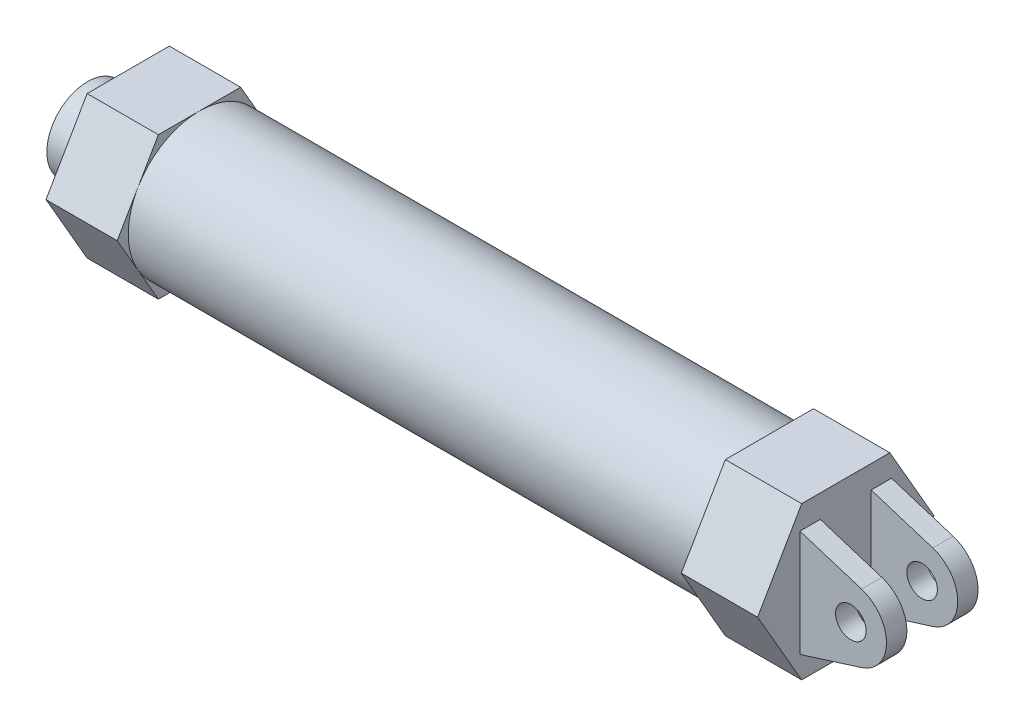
ISO-10303-21;
HEADER;
FILE_DESCRIPTION(('STEP AP214'),'2;1');
FILE_NAME('part.step','',(''),(''),'','','');
FILE_SCHEMA(('AUTOMOTIVE_DESIGN { 1 0 10303 214 1 1 1 1 }'));
ENDSEC;
DATA;
#1=APPLICATION_CONTEXT('core data for automotive mechanical design processes');
#2=APPLICATION_PROTOCOL_DEFINITION('international standard','automotive_design',2000,#1);
#3=PRODUCT_CONTEXT('',#1,'mechanical');
#4=PRODUCT('Part','Part','',(#3));
#5=PRODUCT_RELATED_PRODUCT_CATEGORY('part','',(#4));
#6=PRODUCT_DEFINITION_FORMATION('','',#4);
#7=PRODUCT_DEFINITION_CONTEXT('part definition',#1,'design');
#8=PRODUCT_DEFINITION('design','',#6,#7);
#9=PRODUCT_DEFINITION_SHAPE('','',#8);
#10=(LENGTH_UNIT() NAMED_UNIT(*) SI_UNIT(.MILLI.,.METRE.));
#11=(NAMED_UNIT(*) PLANE_ANGLE_UNIT() SI_UNIT($,.RADIAN.));
#12=(NAMED_UNIT(*) SI_UNIT($,.STERADIAN.) SOLID_ANGLE_UNIT());
#13=UNCERTAINTY_MEASURE_WITH_UNIT(LENGTH_MEASURE(1.E-05),#10,'distance_accuracy_value','');
#14=(GEOMETRIC_REPRESENTATION_CONTEXT(3) GLOBAL_UNCERTAINTY_ASSIGNED_CONTEXT((#13)) GLOBAL_UNIT_ASSIGNED_CONTEXT((#10,
#11,#12)) REPRESENTATION_CONTEXT('',''));
#15=CARTESIAN_POINT('',(0.,0.,0.));
#16=DIRECTION('',(0.,0.,1.));
#17=DIRECTION('',(1.,0.,0.));
#18=AXIS2_PLACEMENT_3D('',#15,#16,#17);
#19=CARTESIAN_POINT('',(31.75,0.,28.575));
#20=DIRECTION('',(0.,0.,-1.));
#21=DIRECTION('',(-1.,0.,0.));
#22=AXIS2_PLACEMENT_3D('',#19,#20,#21);
#23=CYLINDRICAL_SURFACE('',#22,22.225);
#24=DIRECTION('',(0.,0.,-1.));
#25=VECTOR('',#24,1.);
#26=CARTESIAN_POINT('',(38.4331863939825,-21.1963592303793,28.575));
#27=LINE('',#26,#25);
#28=CARTESIAN_POINT('',(38.4331863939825,-21.1963592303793,28.575));
#29=VERTEX_POINT('',#28);
#30=CARTESIAN_POINT('',(38.4331863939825,-21.1963592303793,15.875));
#31=VERTEX_POINT('',#30);
#32=EDGE_CURVE('E210',#29,#31,#27,.T.);
#33=ORIENTED_EDGE('',*,*,#32,.T.);
#34=CARTESIAN_POINT('',(31.75,0.,15.875));
#35=DIRECTION('',(0.,0.,-1.));
#36=DIRECTION('',(-1.,0.,0.));
#37=AXIS2_PLACEMENT_3D('',#34,#35,#36);
#38=CIRCLE('',#37,22.225);
#39=CARTESIAN_POINT('',(38.4331863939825,21.1963592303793,15.875));
#40=VERTEX_POINT('',#39);
#41=EDGE_CURVE('E50',#40,#31,#38,.T.);
#42=ORIENTED_EDGE('',*,*,#41,.F.);
#43=DIRECTION('',(0.,0.,-1.));
#44=VECTOR('',#43,1.);
#45=CARTESIAN_POINT('',(38.4331863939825,21.1963592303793,28.575));
#46=LINE('',#45,#44);
#47=CARTESIAN_POINT('',(38.4331863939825,21.1963592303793,28.575));
#48=VERTEX_POINT('',#47);
#49=EDGE_CURVE('E215',#48,#40,#46,.T.);
#50=ORIENTED_EDGE('',*,*,#49,.F.);
#51=CARTESIAN_POINT('',(31.75,0.,28.575));
#52=DIRECTION('',(0.,0.,1.));
#53=DIRECTION('',(1.,0.,0.));
#54=AXIS2_PLACEMENT_3D('',#51,#52,#53);
#55=CIRCLE('',#54,22.225);
#56=EDGE_CURVE('E364',#29,#48,#55,.T.);
#57=ORIENTED_EDGE('',*,*,#56,.F.);
#58=EDGE_LOOP('',(#33,#42,#50,#57));
#59=FACE_BOUND('',#58,.T.);
#60=ADVANCED_FACE('F33',(#59),#23,.T.);
#61=CARTESIAN_POINT('',(38.4331863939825,21.1963592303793,28.575));
#62=DIRECTION('',(-0.300705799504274,-0.953716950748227,0.));
#63=DIRECTION('',(0.953716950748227,-0.300705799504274,0.));
#64=AXIS2_PLACEMENT_3D('',#61,#62,#63);
#65=PLANE('',#64);
#66=DIRECTION('',(0.953716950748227,-0.300705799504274,0.));
#67=VECTOR('',#66,1.);
#68=CARTESIAN_POINT('',(38.4331863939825,21.1963592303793,15.875));
#69=LINE('',#68,#67);
#70=CARTESIAN_POINT('',(0.,33.3142963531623,15.875));
#71=VERTEX_POINT('',#70);
#72=EDGE_CURVE('E347',#71,#40,#69,.T.);
#73=ORIENTED_EDGE('',*,*,#72,.F.);
#74=DIRECTION('',(0.,0.,-1.));
#75=VECTOR('',#74,1.);
#76=CARTESIAN_POINT('',(0.,33.3142963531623,28.575));
#77=LINE('',#76,#75);
#78=CARTESIAN_POINT('',(0.,33.3142963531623,28.575));
#79=VERTEX_POINT('',#78);
#80=EDGE_CURVE('E202',#79,#71,#77,.T.);
#81=ORIENTED_EDGE('',*,*,#80,.F.);
#82=DIRECTION('',(-0.953716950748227,0.300705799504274,0.));
#83=VECTOR('',#82,1.);
#84=CARTESIAN_POINT('',(38.4331863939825,21.1963592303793,28.575));
#85=LINE('',#84,#83);
#86=EDGE_CURVE('E367',#48,#79,#85,.T.);
#87=ORIENTED_EDGE('',*,*,#86,.F.);
#88=ORIENTED_EDGE('',*,*,#49,.T.);
#89=EDGE_LOOP('',(#73,#81,#87,#88));
#90=FACE_BOUND('',#89,.T.);
#91=ADVANCED_FACE('F405',(#90),#65,.F.);
#92=CARTESIAN_POINT('',(38.4331863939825,-21.1963592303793,28.575));
#93=DIRECTION('',(0.300705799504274,-0.953716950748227,0.));
#94=DIRECTION('',(0.953716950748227,0.300705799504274,0.));
#95=AXIS2_PLACEMENT_3D('',#92,#93,#94);
#96=PLANE('',#95);
#97=DIRECTION('',(0.,0.,-1.));
#98=VECTOR('',#97,1.);
#99=CARTESIAN_POINT('',(0.,-33.3142963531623,28.575));
#100=LINE('',#99,#98);
#101=CARTESIAN_POINT('',(0.,-33.3142963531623,28.575));
#102=VERTEX_POINT('',#101);
#103=CARTESIAN_POINT('',(0.,-33.3142963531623,15.875));
#104=VERTEX_POINT('',#103);
#105=EDGE_CURVE('E200',#102,#104,#100,.T.);
#106=ORIENTED_EDGE('',*,*,#105,.T.);
#107=DIRECTION('',(0.953716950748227,0.300705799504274,0.));
#108=VECTOR('',#107,1.);
#109=CARTESIAN_POINT('',(38.4331863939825,-21.1963592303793,15.875));
#110=LINE('',#109,#108);
#111=EDGE_CURVE('E187',#104,#31,#110,.T.);
#112=ORIENTED_EDGE('',*,*,#111,.T.);
#113=ORIENTED_EDGE('',*,*,#32,.F.);
#114=DIRECTION('',(-0.953716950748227,-0.300705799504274,0.));
#115=VECTOR('',#114,1.);
#116=CARTESIAN_POINT('',(38.4331863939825,-21.1963592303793,28.575));
#117=LINE('',#116,#115);
#118=EDGE_CURVE('E58',#29,#102,#117,.T.);
#119=ORIENTED_EDGE('',*,*,#118,.T.);
#120=EDGE_LOOP('',(#106,#112,#113,#119));
#121=FACE_BOUND('',#120,.T.);
#122=ADVANCED_FACE('F205',(#121),#96,.T.);
#123=CARTESIAN_POINT('',(31.75,0.,28.575));
#124=DIRECTION('',(0.,0.,-1.));
#125=DIRECTION('',(-1.,0.,0.));
#126=AXIS2_PLACEMENT_3D('',#123,#124,#125);
#127=CYLINDRICAL_SURFACE('',#126,9.525);
#128=CARTESIAN_POINT('',(31.75,0.,28.575));
#129=DIRECTION('',(0.,0.,1.));
#130=DIRECTION('',(1.,0.,0.));
#131=AXIS2_PLACEMENT_3D('',#128,#129,#130);
#132=CIRCLE('',#131,9.525);
#133=CARTESIAN_POINT('',(41.275,0.,28.575));
#134=VERTEX_POINT('',#133);
#135=EDGE_CURVE('E358',#134,#134,#132,.T.);
#136=ORIENTED_EDGE('',*,*,#135,.T.);
#137=EDGE_LOOP('',(#136));
#138=FACE_BOUND('',#137,.T.);
#139=CARTESIAN_POINT('',(31.75,0.,15.875));
#140=DIRECTION('',(0.,0.,-1.));
#141=DIRECTION('',(-1.,0.,0.));
#142=AXIS2_PLACEMENT_3D('',#139,#140,#141);
#143=CIRCLE('',#142,9.525);
#144=CARTESIAN_POINT('',(22.225,0.,15.875));
#145=VERTEX_POINT('',#144);
#146=EDGE_CURVE('E193',#145,#145,#143,.T.);
#147=ORIENTED_EDGE('',*,*,#146,.T.);
#148=EDGE_LOOP('',(#147));
#149=FACE_BOUND('',#148,.T.);
#150=ADVANCED_FACE('F412',(#138,#149),#127,.F.);
#151=CARTESIAN_POINT('',(0.,-47.625,-82.4889197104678));
#152=DIRECTION('',(-1.,0.,0.));
#153=DIRECTION('',(0.,0.,1.));
#154=AXIS2_PLACEMENT_3D('',#151,#152,#153);
#155=PLANE('',#154);
#156=DIRECTION('',(0.,1.,0.));
#157=VECTOR('',#156,1.);
#158=CARTESIAN_POINT('',(0.,-47.625,-15.875));
#159=LINE('',#158,#157);
#160=CARTESIAN_POINT('',(0.,-33.3142963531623,-15.875));
#161=VERTEX_POINT('',#160);
#162=CARTESIAN_POINT('',(0.,33.3142963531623,-15.875));
#163=VERTEX_POINT('',#162);
#164=EDGE_CURVE('E203',#161,#163,#159,.T.);
#165=ORIENTED_EDGE('',*,*,#164,.T.);
#166=CARTESIAN_POINT('',(0.,33.3142963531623,-28.575));
#167=VERTEX_POINT('',#166);
#168=EDGE_CURVE('E206',#163,#167,#77,.T.);
#169=ORIENTED_EDGE('',*,*,#168,.T.);
#170=DIRECTION('',(0.,-1.,0.));
#171=VECTOR('',#170,1.);
#172=CARTESIAN_POINT('',(0.,33.3142963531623,-28.575));
#173=LINE('',#172,#171);
#174=CARTESIAN_POINT('',(0.,-33.3142963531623,-28.575));
#175=VERTEX_POINT('',#174);
#176=EDGE_CURVE('E379',#167,#175,#173,.T.);
#177=ORIENTED_EDGE('',*,*,#176,.T.);
#178=EDGE_CURVE('E207',#161,#175,#100,.T.);
#179=ORIENTED_EDGE('',*,*,#178,.F.);
#180=EDGE_LOOP('',(#165,#169,#177,#179));
#181=FACE_BOUND('',#180,.T.);
#182=DIRECTION('',(0.,0.,1.));
#183=VECTOR('',#182,1.);
#184=CARTESIAN_POINT('',(0.,47.625,-27.4963065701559));
#185=LINE('',#184,#183);
#186=CARTESIAN_POINT('',(0.,47.625,-27.4963065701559));
#187=VERTEX_POINT('',#186);
#188=CARTESIAN_POINT('',(0.,47.625,27.4963065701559));
#189=VERTEX_POINT('',#188);
#190=EDGE_CURVE('E316',#187,#189,#185,.T.);
#191=ORIENTED_EDGE('',*,*,#190,.T.);
#192=DIRECTION('',(0.,-0.866025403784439,0.5));
#193=VECTOR('',#192,1.);
#194=CARTESIAN_POINT('',(0.,47.625,27.4963065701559));
#195=LINE('',#194,#193);
#196=CARTESIAN_POINT('',(0.,0.,54.9926131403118));
#197=VERTEX_POINT('',#196);
#198=EDGE_CURVE('E318',#189,#197,#195,.T.);
#199=ORIENTED_EDGE('',*,*,#198,.T.);
#200=DIRECTION('',(0.,-0.866025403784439,-0.5));
#201=VECTOR('',#200,1.);
#202=CARTESIAN_POINT('',(0.,0.,54.9926131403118));
#203=LINE('',#202,#201);
#204=CARTESIAN_POINT('',(0.,-47.625,27.4963065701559));
#205=VERTEX_POINT('',#204);
#206=EDGE_CURVE('E321',#197,#205,#203,.T.);
#207=ORIENTED_EDGE('',*,*,#206,.T.);
#208=DIRECTION('',(0.,0.,-1.));
#209=VECTOR('',#208,1.);
#210=CARTESIAN_POINT('',(0.,-47.625,27.4963065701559));
#211=LINE('',#210,#209);
#212=CARTESIAN_POINT('',(0.,-47.625,-27.4963065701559));
#213=VERTEX_POINT('',#212);
#214=EDGE_CURVE('E324',#205,#213,#211,.T.);
#215=ORIENTED_EDGE('',*,*,#214,.T.);
#216=DIRECTION('',(0.,0.866025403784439,-0.5));
#217=VECTOR('',#216,1.);
#218=CARTESIAN_POINT('',(0.,-47.625,-27.4963065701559));
#219=LINE('',#218,#217);
#220=CARTESIAN_POINT('',(0.,0.,-54.9926131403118));
#221=VERTEX_POINT('',#220);
#222=EDGE_CURVE('E298',#213,#221,#219,.T.);
#223=ORIENTED_EDGE('',*,*,#222,.T.);
#224=DIRECTION('',(0.,0.866025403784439,0.5));
#225=VECTOR('',#224,1.);
#226=CARTESIAN_POINT('',(0.,0.,-54.9926131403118));
#227=LINE('',#226,#225);
#228=EDGE_CURVE('E289',#221,#187,#227,.T.);
#229=ORIENTED_EDGE('',*,*,#228,.T.);
#230=EDGE_LOOP('',(#191,#199,#207,#215,#223,#229));
#231=FACE_BOUND('',#230,.T.);
#232=ORIENTED_EDGE('',*,*,#80,.T.);
#233=DIRECTION('',(0.,1.,0.));
#234=VECTOR('',#233,1.);
#235=CARTESIAN_POINT('',(0.,-47.625,15.875));
#236=LINE('',#235,#234);
#237=EDGE_CURVE('E190',#104,#71,#236,.T.);
#238=ORIENTED_EDGE('',*,*,#237,.F.);
#239=ORIENTED_EDGE('',*,*,#105,.F.);
#240=DIRECTION('',(0.,-1.,0.));
#241=VECTOR('',#240,1.);
#242=CARTESIAN_POINT('',(0.,33.3142963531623,28.575));
#243=LINE('',#242,#241);
#244=EDGE_CURVE('E370',#79,#102,#243,.T.);
#245=ORIENTED_EDGE('',*,*,#244,.F.);
#246=EDGE_LOOP('',(#232,#238,#239,#245));
#247=FACE_BOUND('',#246,.T.);
#248=ADVANCED_FACE('F198',(#181,#231,#247),#155,.F.);
#249=CARTESIAN_POINT('',(-447.675,44.45,-25.6632194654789));
#250=DIRECTION('',(-1.,0.,0.));
#251=DIRECTION('',(0.,0.,1.));
#252=AXIS2_PLACEMENT_3D('',#249,#250,#251);
#253=PLANE('',#252);
#254=DIRECTION('',(0.,0.,-1.));
#255=VECTOR('',#254,1.);
#256=CARTESIAN_POINT('',(-447.675,44.45,25.6632194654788));
#257=LINE('',#256,#255);
#258=CARTESIAN_POINT('',(-447.675,44.45,25.6632194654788));
#259=VERTEX_POINT('',#258);
#260=CARTESIAN_POINT('',(-447.675,44.45,-25.6632194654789));
#261=VERTEX_POINT('',#260);
#262=EDGE_CURVE('E231',#259,#261,#257,.T.);
#263=ORIENTED_EDGE('',*,*,#262,.T.);
#264=DIRECTION('',(0.,-0.866025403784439,-0.499999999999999));
#265=VECTOR('',#264,1.);
#266=CARTESIAN_POINT('',(-447.675,44.45,-25.6632194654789));
#267=LINE('',#266,#265);
#268=CARTESIAN_POINT('',(-447.675,0.,-51.3264389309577));
#269=VERTEX_POINT('',#268);
#270=EDGE_CURVE('E234',#261,#269,#267,.T.);
#271=ORIENTED_EDGE('',*,*,#270,.T.);
#272=DIRECTION('',(0.,-0.866025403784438,0.5));
#273=VECTOR('',#272,1.);
#274=CARTESIAN_POINT('',(-447.675,0.,-51.3264389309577));
#275=LINE('',#274,#273);
#276=CARTESIAN_POINT('',(-447.675,-44.45,-25.6632194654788));
#277=VERTEX_POINT('',#276);
#278=EDGE_CURVE('E237',#269,#277,#275,.T.);
#279=ORIENTED_EDGE('',*,*,#278,.T.);
#280=DIRECTION('',(0.,0.,1.));
#281=VECTOR('',#280,1.);
#282=CARTESIAN_POINT('',(-447.675,-44.45,-25.6632194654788));
#283=LINE('',#282,#281);
#284=CARTESIAN_POINT('',(-447.675,-44.45,25.6632194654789));
#285=VERTEX_POINT('',#284);
#286=EDGE_CURVE('E239',#277,#285,#283,.T.);
#287=ORIENTED_EDGE('',*,*,#286,.T.);
#288=DIRECTION('',(0.,0.866025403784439,0.5));
#289=VECTOR('',#288,1.);
#290=CARTESIAN_POINT('',(-447.675,-44.45,25.6632194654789));
#291=LINE('',#290,#289);
#292=CARTESIAN_POINT('',(-447.675,0.,51.3264389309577));
#293=VERTEX_POINT('',#292);
#294=EDGE_CURVE('E241',#285,#293,#291,.T.);
#295=ORIENTED_EDGE('',*,*,#294,.T.);
#296=DIRECTION('',(0.,0.866025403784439,-0.5));
#297=VECTOR('',#296,1.);
#298=CARTESIAN_POINT('',(-447.675,0.,51.3264389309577));
#299=LINE('',#298,#297);
#300=EDGE_CURVE('E243',#293,#259,#299,.T.);
#301=ORIENTED_EDGE('',*,*,#300,.T.);
#302=EDGE_LOOP('',(#263,#271,#279,#287,#295,#301));
#303=FACE_BOUND('',#302,.T.);
#304=CARTESIAN_POINT('',(-447.675,0.,0.));
#305=DIRECTION('',(-1.,0.,0.));
#306=DIRECTION('',(0.,0.,1.));
#307=AXIS2_PLACEMENT_3D('',#304,#305,#306);
#308=CIRCLE('',#307,25.4);
#309=CARTESIAN_POINT('',(-447.675,0.,25.4));
#310=VERTEX_POINT('',#309);
#311=EDGE_CURVE('E224',#310,#310,#308,.T.);
#312=ORIENTED_EDGE('',*,*,#311,.F.);
#313=EDGE_LOOP('',(#312));
#314=FACE_BOUND('',#313,.T.);
#315=ADVANCED_FACE('F444',(#303,#314),#253,.T.);
#316=CARTESIAN_POINT('',(-47.625,-47.625,-82.4889197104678));
#317=DIRECTION('',(-1.,0.,0.));
#318=DIRECTION('',(0.,0.,1.));
#319=AXIS2_PLACEMENT_3D('',#316,#317,#318);
#320=PLANE('',#319);
#321=DIRECTION('',(0.,0.866025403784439,0.5));
#322=VECTOR('',#321,1.);
#323=CARTESIAN_POINT('',(-47.625,0.,-54.9926131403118));
#324=LINE('',#323,#322);
#325=CARTESIAN_POINT('',(-47.625,0.,-54.9926131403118));
#326=VERTEX_POINT('',#325);
#327=CARTESIAN_POINT('',(-47.625,47.625,-27.4963065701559));
#328=VERTEX_POINT('',#327);
#329=EDGE_CURVE('E294',#326,#328,#324,.T.);
#330=ORIENTED_EDGE('',*,*,#329,.F.);
#331=DIRECTION('',(0.,0.866025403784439,-0.5));
#332=VECTOR('',#331,1.);
#333=CARTESIAN_POINT('',(-47.625,-47.625,-27.4963065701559));
#334=LINE('',#333,#332);
#335=CARTESIAN_POINT('',(-47.625,-47.625,-27.4963065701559));
#336=VERTEX_POINT('',#335);
#337=EDGE_CURVE('E310',#336,#326,#334,.T.);
#338=ORIENTED_EDGE('',*,*,#337,.F.);
#339=DIRECTION('',(0.,0.,-1.));
#340=VECTOR('',#339,1.);
#341=CARTESIAN_POINT('',(-47.625,-47.625,27.4963065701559));
#342=LINE('',#341,#340);
#343=CARTESIAN_POINT('',(-47.625,-47.625,27.4963065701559));
#344=VERTEX_POINT('',#343);
#345=EDGE_CURVE('E307',#344,#336,#342,.T.);
#346=ORIENTED_EDGE('',*,*,#345,.F.);
#347=DIRECTION('',(0.,-0.866025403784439,-0.5));
#348=VECTOR('',#347,1.);
#349=CARTESIAN_POINT('',(-47.625,0.,54.9926131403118));
#350=LINE('',#349,#348);
#351=CARTESIAN_POINT('',(-47.625,0.,54.9926131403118));
#352=VERTEX_POINT('',#351);
#353=EDGE_CURVE('E304',#352,#344,#350,.T.);
#354=ORIENTED_EDGE('',*,*,#353,.F.);
#355=DIRECTION('',(0.,-0.866025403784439,0.5));
#356=VECTOR('',#355,1.);
#357=CARTESIAN_POINT('',(-47.625,47.625,27.4963065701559));
#358=LINE('',#357,#356);
#359=CARTESIAN_POINT('',(-47.625,47.625,27.4963065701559));
#360=VERTEX_POINT('',#359);
#361=EDGE_CURVE('E301',#360,#352,#358,.T.);
#362=ORIENTED_EDGE('',*,*,#361,.F.);
#363=DIRECTION('',(0.,0.,1.));
#364=VECTOR('',#363,1.);
#365=CARTESIAN_POINT('',(-47.625,47.625,-27.4963065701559));
#366=LINE('',#365,#364);
#367=EDGE_CURVE('E297',#328,#360,#366,.T.);
#368=ORIENTED_EDGE('',*,*,#367,.F.);
#369=EDGE_LOOP('',(#330,#338,#346,#354,#362,#368));
#370=FACE_BOUND('',#369,.T.);
#371=CARTESIAN_POINT('',(-47.625,0.,0.));
#372=DIRECTION('',(-1.,0.,0.));
#373=DIRECTION('',(0.,0.,1.));
#374=AXIS2_PLACEMENT_3D('',#371,#372,#373);
#375=CIRCLE('',#374,44.45);
#376=CARTESIAN_POINT('',(-47.625,0.,44.45));
#377=VERTEX_POINT('',#376);
#378=EDGE_CURVE('E285',#377,#377,#375,.T.);
#379=ORIENTED_EDGE('',*,*,#378,.F.);
#380=EDGE_LOOP('',(#379));
#381=FACE_BOUND('',#380,.T.);
#382=ADVANCED_FACE('F447',(#370,#381),#320,.T.);
#383=CARTESIAN_POINT('',(-47.625,0.,-54.9926131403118));
#384=DIRECTION('',(0.,0.5,-0.866025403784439));
#385=DIRECTION('',(0.,0.866025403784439,0.5));
#386=AXIS2_PLACEMENT_3D('',#383,#384,#385);
#387=PLANE('',#386);
#388=ORIENTED_EDGE('',*,*,#228,.F.);
#389=DIRECTION('',(1.,0.,0.));
#390=VECTOR('',#389,1.);
#391=CARTESIAN_POINT('',(-47.625,0.,-54.9926131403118));
#392=LINE('',#391,#390);
#393=EDGE_CURVE('E11',#326,#221,#392,.T.);
#394=ORIENTED_EDGE('',*,*,#393,.F.);
#395=ORIENTED_EDGE('',*,*,#329,.T.);
#396=DIRECTION('',(1.,0.,0.));
#397=VECTOR('',#396,1.);
#398=CARTESIAN_POINT('',(-47.625,47.625,-27.4963065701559));
#399=LINE('',#398,#397);
#400=EDGE_CURVE('E313',#328,#187,#399,.T.);
#401=ORIENTED_EDGE('',*,*,#400,.T.);
#402=EDGE_LOOP('',(#388,#394,#395,#401));
#403=FACE_BOUND('',#402,.T.);
#404=ADVANCED_FACE('F35',(#403),#387,.T.);
#405=CARTESIAN_POINT('',(-47.625,-47.625,-27.4963065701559));
#406=DIRECTION('',(0.,-0.5,-0.866025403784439));
#407=DIRECTION('',(0.,0.866025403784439,-0.5));
#408=AXIS2_PLACEMENT_3D('',#405,#406,#407);
#409=PLANE('',#408);
#410=ORIENTED_EDGE('',*,*,#222,.F.);
#411=DIRECTION('',(1.,0.,0.));
#412=VECTOR('',#411,1.);
#413=CARTESIAN_POINT('',(-47.625,-47.625,-27.4963065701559));
#414=LINE('',#413,#412);
#415=EDGE_CURVE('E42',#336,#213,#414,.T.);
#416=ORIENTED_EDGE('',*,*,#415,.F.);
#417=ORIENTED_EDGE('',*,*,#337,.T.);
#418=ORIENTED_EDGE('',*,*,#393,.T.);
#419=EDGE_LOOP('',(#410,#416,#417,#418));
#420=FACE_BOUND('',#419,.T.);
#421=ADVANCED_FACE('F488',(#420),#409,.T.);
#422=CARTESIAN_POINT('',(-47.625,-47.625,27.4963065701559));
#423=DIRECTION('',(0.,-1.,0.));
#424=DIRECTION('',(0.,0.,-1.));
#425=AXIS2_PLACEMENT_3D('',#422,#423,#424);
#426=PLANE('',#425);
#427=ORIENTED_EDGE('',*,*,#214,.F.);
#428=DIRECTION('',(1.,0.,0.));
#429=VECTOR('',#428,1.);
#430=CARTESIAN_POINT('',(-47.625,-47.625,27.4963065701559));
#431=LINE('',#430,#429);
#432=EDGE_CURVE('E330',#344,#205,#431,.T.);
#433=ORIENTED_EDGE('',*,*,#432,.F.);
#434=ORIENTED_EDGE('',*,*,#345,.T.);
#435=ORIENTED_EDGE('',*,*,#415,.T.);
#436=EDGE_LOOP('',(#427,#433,#434,#435));
#437=FACE_BOUND('',#436,.T.);
#438=ADVANCED_FACE('F491',(#437),#426,.T.);
#439=CARTESIAN_POINT('',(-47.625,0.,54.9926131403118));
#440=DIRECTION('',(0.,-0.5,0.866025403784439));
#441=DIRECTION('',(0.,-0.866025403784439,-0.5));
#442=AXIS2_PLACEMENT_3D('',#439,#440,#441);
#443=PLANE('',#442);
#444=ORIENTED_EDGE('',*,*,#206,.F.);
#445=DIRECTION('',(1.,0.,0.));
#446=VECTOR('',#445,1.);
#447=CARTESIAN_POINT('',(-47.625,0.,54.9926131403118));
#448=LINE('',#447,#446);
#449=EDGE_CURVE('E332',#352,#197,#448,.T.);
#450=ORIENTED_EDGE('',*,*,#449,.F.);
#451=ORIENTED_EDGE('',*,*,#353,.T.);
#452=ORIENTED_EDGE('',*,*,#432,.T.);
#453=EDGE_LOOP('',(#444,#450,#451,#452));
#454=FACE_BOUND('',#453,.T.);
#455=ADVANCED_FACE('F495',(#454),#443,.T.);
#456=CARTESIAN_POINT('',(-47.625,47.625,27.4963065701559));
#457=DIRECTION('',(0.,0.5,0.866025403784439));
#458=DIRECTION('',(0.,-0.866025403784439,0.5));
#459=AXIS2_PLACEMENT_3D('',#456,#457,#458);
#460=PLANE('',#459);
#461=ORIENTED_EDGE('',*,*,#198,.F.);
#462=DIRECTION('',(1.,0.,0.));
#463=VECTOR('',#462,1.);
#464=CARTESIAN_POINT('',(-47.625,47.625,27.4963065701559));
#465=LINE('',#464,#463);
#466=EDGE_CURVE('E334',#360,#189,#465,.T.);
#467=ORIENTED_EDGE('',*,*,#466,.F.);
#468=ORIENTED_EDGE('',*,*,#361,.T.);
#469=ORIENTED_EDGE('',*,*,#449,.T.);
#470=EDGE_LOOP('',(#461,#467,#468,#469));
#471=FACE_BOUND('',#470,.T.);
#472=ADVANCED_FACE('F499',(#471),#460,.T.);
#473=CARTESIAN_POINT('',(-47.625,47.625,-27.4963065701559));
#474=DIRECTION('',(0.,1.,0.));
#475=DIRECTION('',(0.,0.,1.));
#476=AXIS2_PLACEMENT_3D('',#473,#474,#475);
#477=PLANE('',#476);
#478=ORIENTED_EDGE('',*,*,#190,.F.);
#479=ORIENTED_EDGE('',*,*,#400,.F.);
#480=ORIENTED_EDGE('',*,*,#367,.T.);
#481=ORIENTED_EDGE('',*,*,#466,.T.);
#482=EDGE_LOOP('',(#478,#479,#480,#481));
#483=FACE_BOUND('',#482,.T.);
#484=ADVANCED_FACE('F481',(#483),#477,.T.);
#485=CARTESIAN_POINT('',(-403.225,0.,0.));
#486=DIRECTION('',(1.,0.,0.));
#487=DIRECTION('',(0.,0.,-1.));
#488=AXIS2_PLACEMENT_3D('',#485,#486,#487);
#489=CYLINDRICAL_SURFACE('',#488,44.45);
#490=CARTESIAN_POINT('',(-403.225,0.,0.));
#491=DIRECTION('',(-1.,0.,0.));
#492=DIRECTION('',(0.,0.,1.));
#493=AXIS2_PLACEMENT_3D('',#490,#491,#492);
#494=CIRCLE('',#493,44.45);
#495=CARTESIAN_POINT('',(-403.225,22.225,38.4948291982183));
#496=VERTEX_POINT('',#495);
#497=CARTESIAN_POINT('',(-403.225,44.45,0.));
#498=VERTEX_POINT('',#497);
#499=EDGE_CURVE('E286',#496,#498,#494,.T.);
#500=ORIENTED_EDGE('',*,*,#499,.F.);
#501=CARTESIAN_POINT('',(-403.225,-22.225,38.4948291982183));
#502=VERTEX_POINT('',#501);
#503=EDGE_CURVE('E291',#502,#496,#494,.T.);
#504=ORIENTED_EDGE('',*,*,#503,.F.);
#505=CARTESIAN_POINT('',(-403.225,-44.45,0.));
#506=VERTEX_POINT('',#505);
#507=EDGE_CURVE('E782',#506,#502,#494,.T.);
#508=ORIENTED_EDGE('',*,*,#507,.F.);
#509=CARTESIAN_POINT('',(-403.225,-22.225,-38.4948291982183));
#510=VERTEX_POINT('',#509);
#511=EDGE_CURVE('E784',#510,#506,#494,.T.);
#512=ORIENTED_EDGE('',*,*,#511,.F.);
#513=CARTESIAN_POINT('',(-403.225,22.225,-38.4948291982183));
#514=VERTEX_POINT('',#513);
#515=EDGE_CURVE('E785',#514,#510,#494,.T.);
#516=ORIENTED_EDGE('',*,*,#515,.F.);
#517=EDGE_CURVE('E290',#498,#514,#494,.T.);
#518=ORIENTED_EDGE('',*,*,#517,.F.);
#519=EDGE_LOOP('',(#500,#504,#508,#512,#516,#518));
#520=FACE_BOUND('',#519,.T.);
#521=ORIENTED_EDGE('',*,*,#378,.T.);
#522=EDGE_LOOP('',(#521));
#523=FACE_BOUND('',#522,.T.);
#524=ADVANCED_FACE('F453',(#520,#523),#489,.T.);
#525=CARTESIAN_POINT('',(-403.225,44.45,-25.6632194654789));
#526=DIRECTION('',(-1.,0.,0.));
#527=DIRECTION('',(0.,0.,1.));
#528=AXIS2_PLACEMENT_3D('',#525,#526,#527);
#529=PLANE('',#528);
#530=DIRECTION('',(0.,0.866025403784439,-0.5));
#531=VECTOR('',#530,1.);
#532=CARTESIAN_POINT('',(-403.225,0.,51.3264389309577));
#533=LINE('',#532,#531);
#534=CARTESIAN_POINT('',(-403.225,44.45,25.6632194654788));
#535=VERTEX_POINT('',#534);
#536=EDGE_CURVE('E265',#496,#535,#533,.T.);
#537=ORIENTED_EDGE('',*,*,#536,.F.);
#538=ORIENTED_EDGE('',*,*,#499,.T.);
#539=DIRECTION('',(0.,0.,-1.));
#540=VECTOR('',#539,1.);
#541=CARTESIAN_POINT('',(-403.225,44.45,25.6632194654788));
#542=LINE('',#541,#540);
#543=EDGE_CURVE('E246',#535,#498,#542,.T.);
#544=ORIENTED_EDGE('',*,*,#543,.F.);
#545=EDGE_LOOP('',(#537,#538,#544));
#546=FACE_BOUND('',#545,.T.);
#547=ADVANCED_FACE('F449',(#546),#529,.F.);
#548=CARTESIAN_POINT('',(-403.225,44.45,-25.6632194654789));
#549=VERTEX_POINT('',#548);
#550=EDGE_CURVE('E228',#498,#549,#542,.T.);
#551=ORIENTED_EDGE('',*,*,#550,.F.);
#552=ORIENTED_EDGE('',*,*,#517,.T.);
#553=DIRECTION('',(0.,-0.866025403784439,-0.499999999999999));
#554=VECTOR('',#553,1.);
#555=CARTESIAN_POINT('',(-403.225,44.45,-25.6632194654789));
#556=LINE('',#555,#554);
#557=EDGE_CURVE('E250',#549,#514,#556,.T.);
#558=ORIENTED_EDGE('',*,*,#557,.F.);
#559=EDGE_LOOP('',(#551,#552,#558));
#560=FACE_BOUND('',#559,.T.);
#561=ADVANCED_FACE('F452',(#560),#529,.F.);
#562=CARTESIAN_POINT('',(-403.225,0.,-51.3264389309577));
#563=VERTEX_POINT('',#562);
#564=EDGE_CURVE('E249',#514,#563,#556,.T.);
#565=ORIENTED_EDGE('',*,*,#564,.F.);
#566=ORIENTED_EDGE('',*,*,#515,.T.);
#567=DIRECTION('',(0.,-0.866025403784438,0.5));
#568=VECTOR('',#567,1.);
#569=CARTESIAN_POINT('',(-403.225,0.,-51.3264389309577));
#570=LINE('',#569,#568);
#571=EDGE_CURVE('E254',#563,#510,#570,.T.);
#572=ORIENTED_EDGE('',*,*,#571,.F.);
#573=EDGE_LOOP('',(#565,#566,#572));
#574=FACE_BOUND('',#573,.T.);
#575=ADVANCED_FACE('F571',(#574),#529,.F.);
#576=CARTESIAN_POINT('',(-403.225,-44.45,-25.6632194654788));
#577=VERTEX_POINT('',#576);
#578=EDGE_CURVE('E253',#510,#577,#570,.T.);
#579=ORIENTED_EDGE('',*,*,#578,.F.);
#580=ORIENTED_EDGE('',*,*,#511,.T.);
#581=DIRECTION('',(0.,0.,1.));
#582=VECTOR('',#581,1.);
#583=CARTESIAN_POINT('',(-403.225,-44.45,-25.6632194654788));
#584=LINE('',#583,#582);
#585=EDGE_CURVE('E258',#577,#506,#584,.T.);
#586=ORIENTED_EDGE('',*,*,#585,.F.);
#587=EDGE_LOOP('',(#579,#580,#586));
#588=FACE_BOUND('',#587,.T.);
#589=ADVANCED_FACE('F580',(#588),#529,.F.);
#590=CARTESIAN_POINT('',(-403.225,-44.45,25.6632194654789));
#591=VERTEX_POINT('',#590);
#592=EDGE_CURVE('E257',#506,#591,#584,.T.);
#593=ORIENTED_EDGE('',*,*,#592,.F.);
#594=ORIENTED_EDGE('',*,*,#507,.T.);
#595=DIRECTION('',(0.,0.866025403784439,0.5));
#596=VECTOR('',#595,1.);
#597=CARTESIAN_POINT('',(-403.225,-44.45,25.6632194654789));
#598=LINE('',#597,#596);
#599=EDGE_CURVE('E262',#591,#502,#598,.T.);
#600=ORIENTED_EDGE('',*,*,#599,.F.);
#601=EDGE_LOOP('',(#593,#594,#600));
#602=FACE_BOUND('',#601,.T.);
#603=ADVANCED_FACE('F589',(#602),#529,.F.);
#604=CARTESIAN_POINT('',(-403.225,0.,51.3264389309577));
#605=VERTEX_POINT('',#604);
#606=EDGE_CURVE('E261',#502,#605,#598,.T.);
#607=ORIENTED_EDGE('',*,*,#606,.F.);
#608=ORIENTED_EDGE('',*,*,#503,.T.);
#609=EDGE_CURVE('E235',#605,#496,#533,.T.);
#610=ORIENTED_EDGE('',*,*,#609,.F.);
#611=EDGE_LOOP('',(#607,#608,#610));
#612=FACE_BOUND('',#611,.T.);
#613=ADVANCED_FACE('F455',(#612),#529,.F.);
#614=CARTESIAN_POINT('',(-447.675,44.45,25.6632194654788));
#615=DIRECTION('',(0.,-1.,0.));
#616=DIRECTION('',(0.,0.,-1.));
#617=AXIS2_PLACEMENT_3D('',#614,#615,#616);
#618=PLANE('',#617);
#619=ORIENTED_EDGE('',*,*,#543,.T.);
#620=ORIENTED_EDGE('',*,*,#550,.T.);
#621=DIRECTION('',(1.,0.,0.));
#622=VECTOR('',#621,1.);
#623=CARTESIAN_POINT('',(-447.675,44.45,-25.6632194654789));
#624=LINE('',#623,#622);
#625=EDGE_CURVE('E282',#261,#549,#624,.T.);
#626=ORIENTED_EDGE('',*,*,#625,.F.);
#627=ORIENTED_EDGE('',*,*,#262,.F.);
#628=DIRECTION('',(1.,0.,0.));
#629=VECTOR('',#628,1.);
#630=CARTESIAN_POINT('',(-447.675,44.45,25.6632194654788));
#631=LINE('',#630,#629);
#632=EDGE_CURVE('E245',#259,#535,#631,.T.);
#633=ORIENTED_EDGE('',*,*,#632,.T.);
#634=EDGE_LOOP('',(#619,#620,#626,#627,#633));
#635=FACE_BOUND('',#634,.T.);
#636=ADVANCED_FACE('F474',(#635),#618,.F.);
#637=CARTESIAN_POINT('',(-447.675,44.45,-25.6632194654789));
#638=DIRECTION('',(0.,-0.499999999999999,0.866025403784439));
#639=DIRECTION('',(0.,-0.866025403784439,-0.499999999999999));
#640=AXIS2_PLACEMENT_3D('',#637,#638,#639);
#641=PLANE('',#640);
#642=ORIENTED_EDGE('',*,*,#557,.T.);
#643=ORIENTED_EDGE('',*,*,#564,.T.);
#644=DIRECTION('',(1.,0.,0.));
#645=VECTOR('',#644,1.);
#646=CARTESIAN_POINT('',(-447.675,0.,-51.3264389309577));
#647=LINE('',#646,#645);
#648=EDGE_CURVE('E279',#269,#563,#647,.T.);
#649=ORIENTED_EDGE('',*,*,#648,.F.);
#650=ORIENTED_EDGE('',*,*,#270,.F.);
#651=ORIENTED_EDGE('',*,*,#625,.T.);
#652=EDGE_LOOP('',(#642,#643,#649,#650,#651));
#653=FACE_BOUND('',#652,.T.);
#654=ADVANCED_FACE('F470',(#653),#641,.F.);
#655=CARTESIAN_POINT('',(-447.675,0.,-51.3264389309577));
#656=DIRECTION('',(0.,0.5,0.866025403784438));
#657=DIRECTION('',(0.,-0.866025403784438,0.5));
#658=AXIS2_PLACEMENT_3D('',#655,#656,#657);
#659=PLANE('',#658);
#660=ORIENTED_EDGE('',*,*,#571,.T.);
#661=ORIENTED_EDGE('',*,*,#578,.T.);
#662=DIRECTION('',(1.,0.,0.));
#663=VECTOR('',#662,1.);
#664=CARTESIAN_POINT('',(-447.675,-44.45,-25.6632194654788));
#665=LINE('',#664,#663);
#666=EDGE_CURVE('E276',#277,#577,#665,.T.);
#667=ORIENTED_EDGE('',*,*,#666,.F.);
#668=ORIENTED_EDGE('',*,*,#278,.F.);
#669=ORIENTED_EDGE('',*,*,#648,.T.);
#670=EDGE_LOOP('',(#660,#661,#667,#668,#669));
#671=FACE_BOUND('',#670,.T.);
#672=ADVANCED_FACE('F466',(#671),#659,.F.);
#673=CARTESIAN_POINT('',(-447.675,-44.45,-25.6632194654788));
#674=DIRECTION('',(0.,1.,0.));
#675=DIRECTION('',(0.,0.,1.));
#676=AXIS2_PLACEMENT_3D('',#673,#674,#675);
#677=PLANE('',#676);
#678=ORIENTED_EDGE('',*,*,#585,.T.);
#679=ORIENTED_EDGE('',*,*,#592,.T.);
#680=DIRECTION('',(1.,0.,0.));
#681=VECTOR('',#680,1.);
#682=CARTESIAN_POINT('',(-447.675,-44.45,25.6632194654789));
#683=LINE('',#682,#681);
#684=EDGE_CURVE('E273',#285,#591,#683,.T.);
#685=ORIENTED_EDGE('',*,*,#684,.F.);
#686=ORIENTED_EDGE('',*,*,#286,.F.);
#687=ORIENTED_EDGE('',*,*,#666,.T.);
#688=EDGE_LOOP('',(#678,#679,#685,#686,#687));
#689=FACE_BOUND('',#688,.T.);
#690=ADVANCED_FACE('F462',(#689),#677,.F.);
#691=CARTESIAN_POINT('',(-447.675,-44.45,25.6632194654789));
#692=DIRECTION('',(0.,0.499999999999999,-0.866025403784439));
#693=DIRECTION('',(0.,0.866025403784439,0.5));
#694=AXIS2_PLACEMENT_3D('',#691,#692,#693);
#695=PLANE('',#694);
#696=ORIENTED_EDGE('',*,*,#599,.T.);
#697=ORIENTED_EDGE('',*,*,#606,.T.);
#698=DIRECTION('',(1.,0.,0.));
#699=VECTOR('',#698,1.);
#700=CARTESIAN_POINT('',(-447.675,0.,51.3264389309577));
#701=LINE('',#700,#699);
#702=EDGE_CURVE('E270',#293,#605,#701,.T.);
#703=ORIENTED_EDGE('',*,*,#702,.F.);
#704=ORIENTED_EDGE('',*,*,#294,.F.);
#705=ORIENTED_EDGE('',*,*,#684,.T.);
#706=EDGE_LOOP('',(#696,#697,#703,#704,#705));
#707=FACE_BOUND('',#706,.T.);
#708=ADVANCED_FACE('F458',(#707),#695,.F.);
#709=CARTESIAN_POINT('',(-447.675,0.,51.3264389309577));
#710=DIRECTION('',(0.,-0.5,-0.866025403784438));
#711=DIRECTION('',(0.,0.866025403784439,-0.5));
#712=AXIS2_PLACEMENT_3D('',#709,#710,#711);
#713=PLANE('',#712);
#714=ORIENTED_EDGE('',*,*,#609,.T.);
#715=ORIENTED_EDGE('',*,*,#536,.T.);
#716=ORIENTED_EDGE('',*,*,#632,.F.);
#717=ORIENTED_EDGE('',*,*,#300,.F.);
#718=ORIENTED_EDGE('',*,*,#702,.T.);
#719=EDGE_LOOP('',(#714,#715,#716,#717,#718));
#720=FACE_BOUND('',#719,.T.);
#721=ADVANCED_FACE('F442',(#720),#713,.F.);
#722=CARTESIAN_POINT('',(-473.075,0.,0.));
#723=DIRECTION('',(1.,0.,0.));
#724=DIRECTION('',(0.,0.,-1.));
#725=AXIS2_PLACEMENT_3D('',#722,#723,#724);
#726=CYLINDRICAL_SURFACE('',#725,25.4);
#727=CARTESIAN_POINT('',(-473.075,0.,0.));
#728=DIRECTION('',(-1.,0.,0.));
#729=DIRECTION('',(0.,0.,1.));
#730=AXIS2_PLACEMENT_3D('',#727,#728,#729);
#731=CIRCLE('',#730,25.4);
#732=CARTESIAN_POINT('',(-473.075,0.,25.4));
#733=VERTEX_POINT('',#732);
#734=EDGE_CURVE('E225',#733,#733,#731,.T.);
#735=ORIENTED_EDGE('',*,*,#734,.F.);
#736=EDGE_LOOP('',(#735));
#737=FACE_BOUND('',#736,.T.);
#738=ORIENTED_EDGE('',*,*,#311,.T.);
#739=EDGE_LOOP('',(#738));
#740=FACE_BOUND('',#739,.T.);
#741=ADVANCED_FACE('F438',(#737,#740),#726,.T.);
#742=CARTESIAN_POINT('',(-473.075,0.,0.));
#743=DIRECTION('',(-1.,0.,0.));
#744=DIRECTION('',(0.,0.,1.));
#745=AXIS2_PLACEMENT_3D('',#742,#743,#744);
#746=PLANE('',#745);
#747=CARTESIAN_POINT('',(-473.075,0.,0.));
#748=DIRECTION('',(-1.,0.,0.));
#749=DIRECTION('',(0.,0.,1.));
#750=AXIS2_PLACEMENT_3D('',#747,#748,#749);
#751=CIRCLE('',#750,17.4625);
#752=CARTESIAN_POINT('',(-473.075,0.,17.4625));
#753=VERTEX_POINT('',#752);
#754=EDGE_CURVE('E218',#753,#753,#751,.T.);
#755=ORIENTED_EDGE('',*,*,#754,.F.);
#756=EDGE_LOOP('',(#755));
#757=FACE_BOUND('',#756,.T.);
#758=ORIENTED_EDGE('',*,*,#734,.T.);
#759=EDGE_LOOP('',(#758));
#760=FACE_BOUND('',#759,.T.);
#761=ADVANCED_FACE('F434',(#757,#760),#746,.T.);
#762=CARTESIAN_POINT('',(1.76640866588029,0.,0.));
#763=DIRECTION('',(-1.,0.,0.));
#764=DIRECTION('',(0.,0.,1.));
#765=AXIS2_PLACEMENT_3D('',#762,#763,#764);
#766=CYLINDRICAL_SURFACE('',#765,17.4625);
#767=CARTESIAN_POINT('',(-47.625,0.,0.));
#768=DIRECTION('',(-1.,0.,0.));
#769=DIRECTION('',(0.,0.,1.));
#770=AXIS2_PLACEMENT_3D('',#767,#768,#769);
#771=CIRCLE('',#770,17.4625);
#772=CARTESIAN_POINT('',(-47.625,0.,17.4625));
#773=VERTEX_POINT('',#772);
#774=EDGE_CURVE('E221',#773,#773,#771,.F.);
#775=CARTESIAN_POINT('',(-47.625,0.,17.4625));
#776=CARTESIAN_POINT('',(-52.0567708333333,0.,17.4625));
#777=CARTESIAN_POINT('',(-56.4885416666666,0.,17.4625));
#778=CARTESIAN_POINT('',(-65.3520833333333,0.,17.4625));
#779=CARTESIAN_POINT('',(-69.7838541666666,0.,17.4625));
#780=CARTESIAN_POINT('',(-78.6473958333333,0.,17.4625));
#781=CARTESIAN_POINT('',(-83.0791666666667,0.,17.4625));
#782=CARTESIAN_POINT('',(-91.9427083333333,0.,17.4625));
#783=CARTESIAN_POINT('',(-96.3744791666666,0.,17.4625));
#784=CARTESIAN_POINT('',(-105.238020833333,0.,17.4625));
#785=CARTESIAN_POINT('',(-109.669791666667,0.,17.4625));
#786=CARTESIAN_POINT('',(-118.533333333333,0.,17.4625));
#787=CARTESIAN_POINT('',(-122.965104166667,0.,17.4625));
#788=CARTESIAN_POINT('',(-131.828645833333,0.,17.4625));
#789=CARTESIAN_POINT('',(-136.260416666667,0.,17.4625));
#790=CARTESIAN_POINT('',(-145.123958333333,0.,17.4625));
#791=CARTESIAN_POINT('',(-149.555729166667,0.,17.4625));
#792=CARTESIAN_POINT('',(-158.419270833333,0.,17.4625));
#793=CARTESIAN_POINT('',(-162.851041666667,0.,17.4625));
#794=CARTESIAN_POINT('',(-171.714583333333,0.,17.4625));
#795=CARTESIAN_POINT('',(-176.146354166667,0.,17.4625));
#796=CARTESIAN_POINT('',(-185.009895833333,0.,17.4625));
#797=CARTESIAN_POINT('',(-189.441666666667,0.,17.4625));
#798=CARTESIAN_POINT('',(-198.305208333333,0.,17.4625));
#799=CARTESIAN_POINT('',(-202.736979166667,0.,17.4625));
#800=CARTESIAN_POINT('',(-211.600520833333,0.,17.4625));
#801=CARTESIAN_POINT('',(-216.032291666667,0.,17.4625));
#802=CARTESIAN_POINT('',(-224.895833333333,0.,17.4625));
#803=CARTESIAN_POINT('',(-229.327604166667,0.,17.4625));
#804=CARTESIAN_POINT('',(-238.191145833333,0.,17.4625));
#805=CARTESIAN_POINT('',(-242.622916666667,0.,17.4625));
#806=CARTESIAN_POINT('',(-251.486458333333,0.,17.4625));
#807=CARTESIAN_POINT('',(-255.918229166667,0.,17.4625));
#808=CARTESIAN_POINT('',(-264.781770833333,0.,17.4625));
#809=CARTESIAN_POINT('',(-269.213541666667,0.,17.4625));
#810=CARTESIAN_POINT('',(-278.077083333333,0.,17.4625));
#811=CARTESIAN_POINT('',(-282.508854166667,0.,17.4625));
#812=CARTESIAN_POINT('',(-291.372395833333,0.,17.4625));
#813=CARTESIAN_POINT('',(-295.804166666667,0.,17.4625));
#814=CARTESIAN_POINT('',(-304.667708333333,0.,17.4625));
#815=CARTESIAN_POINT('',(-309.099479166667,0.,17.4625));
#816=CARTESIAN_POINT('',(-317.963020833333,0.,17.4625));
#817=CARTESIAN_POINT('',(-322.394791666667,0.,17.4625));
#818=CARTESIAN_POINT('',(-331.258333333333,0.,17.4625));
#819=CARTESIAN_POINT('',(-335.690104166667,0.,17.4625));
#820=CARTESIAN_POINT('',(-344.553645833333,0.,17.4625));
#821=CARTESIAN_POINT('',(-348.985416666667,0.,17.4625));
#822=CARTESIAN_POINT('',(-357.848958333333,0.,17.4625));
#823=CARTESIAN_POINT('',(-362.280729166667,0.,17.4625));
#824=CARTESIAN_POINT('',(-371.144270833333,0.,17.4625));
#825=CARTESIAN_POINT('',(-375.576041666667,0.,17.4625));
#826=CARTESIAN_POINT('',(-384.439583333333,0.,17.4625));
#827=CARTESIAN_POINT('',(-388.871354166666,0.,17.4625));
#828=CARTESIAN_POINT('',(-397.734895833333,0.,17.4625));
#829=CARTESIAN_POINT('',(-402.166666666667,0.,17.4625));
#830=CARTESIAN_POINT('',(-411.030208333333,0.,17.4625));
#831=CARTESIAN_POINT('',(-415.461979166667,0.,17.4625));
#832=CARTESIAN_POINT('',(-424.325520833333,0.,17.4625));
#833=CARTESIAN_POINT('',(-428.757291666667,0.,17.4625));
#834=CARTESIAN_POINT('',(-437.620833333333,0.,17.4625));
#835=CARTESIAN_POINT('',(-442.052604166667,0.,17.4625));
#836=CARTESIAN_POINT('',(-450.916145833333,0.,17.4625));
#837=CARTESIAN_POINT('',(-455.347916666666,0.,17.4625));
#838=CARTESIAN_POINT('',(-464.211458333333,0.,17.4625));
#839=CARTESIAN_POINT('',(-468.643229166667,0.,17.4625));
#840=CARTESIAN_POINT('',(-473.075,0.,17.4625));
#841=B_SPLINE_CURVE_WITH_KNOTS('',3,(#775,#776,#777,#778,#779,#780,#781,#782,#783,#784,#785,
#786,#787,#788,#789,#790,#791,#792,#793,#794,#795,#796,#797,#798,#799,#800,#801,#802,#803,#804,
#805,#806,#807,#808,#809,#810,#811,#812,#813,#814,#815,#816,#817,#818,#819,#820,#821,#822,#823,
#824,#825,#826,#827,#828,#829,#830,#831,#832,#833,#834,#835,#836,#837,#838,#839,#840),
.UNSPECIFIED.,.F.,.F.,(4,2,2,2,2,2,2,2,2,2,2,2,2,2,2,2,2,2,2,2,2,2,2,2,2,2,2,2,2,2,2,2,4),(0.,
13.2953125,26.590625,39.8859375,53.18125,66.4765625,79.771875,93.0671875,106.3625,119.6578125,
132.953125,146.2484375,159.54375,172.8390625,186.134375,199.4296875,212.725,226.0203125,
239.315625,252.6109375,265.90625,279.2015625,292.496875,305.7921875,319.0875,332.3828125,
345.678125,358.9734375,372.26875,385.5640625,398.859375,412.1546875,425.45),.UNSPECIFIED.);
#842=EDGE_CURVE('BSEAM430',#773,#753,#841,.T.);
#843=ORIENTED_EDGE('',*,*,#774,.T.);
#844=ORIENTED_EDGE('',*,*,#754,.T.);
#845=ORIENTED_EDGE('',*,*,#842,.T.);
#846=ORIENTED_EDGE('',*,*,#842,.F.);
#847=EDGE_LOOP('',(#843,#845,#844,#846));
#848=FACE_BOUND('',#847,.T.);
#849=ADVANCED_FACE('F430',(#848),#766,.F.);
#850=CARTESIAN_POINT('',(-47.625,-47.625,-82.4889197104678));
#851=DIRECTION('',(-1.,0.,0.));
#852=DIRECTION('',(0.,0.,1.));
#853=AXIS2_PLACEMENT_3D('',#850,#851,#852);
#854=PLANE('',#853);
#855=ORIENTED_EDGE('',*,*,#774,.F.);
#856=EDGE_LOOP('',(#855));
#857=FACE_BOUND('',#856,.T.);
#858=ADVANCED_FACE('F427',(#857),#854,.T.);
#859=CARTESIAN_POINT('',(31.75,0.,28.575));
#860=DIRECTION('',(0.,0.,1.));
#861=DIRECTION('',(1.,0.,0.));
#862=AXIS2_PLACEMENT_3D('',#859,#860,#861);
#863=PLANE('',#862);
#864=ORIENTED_EDGE('',*,*,#56,.T.);
#865=ORIENTED_EDGE('',*,*,#86,.T.);
#866=ORIENTED_EDGE('',*,*,#244,.T.);
#867=ORIENTED_EDGE('',*,*,#118,.F.);
#868=EDGE_LOOP('',(#864,#865,#866,#867));
#869=FACE_BOUND('',#868,.T.);
#870=ORIENTED_EDGE('',*,*,#135,.F.);
#871=EDGE_LOOP('',(#870));
#872=FACE_BOUND('',#871,.T.);
#873=ADVANCED_FACE('F402',(#869,#872),#863,.T.);
#874=CARTESIAN_POINT('',(31.75,0.,-28.575));
#875=DIRECTION('',(0.,0.,1.));
#876=DIRECTION('',(1.,0.,0.));
#877=AXIS2_PLACEMENT_3D('',#874,#875,#876);
#878=PLANE('',#877);
#879=CARTESIAN_POINT('',(31.75,0.,-28.575));
#880=DIRECTION('',(0.,0.,1.));
#881=DIRECTION('',(1.,0.,0.));
#882=AXIS2_PLACEMENT_3D('',#879,#880,#881);
#883=CIRCLE('',#882,22.225);
#884=CARTESIAN_POINT('',(38.4331863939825,-21.1963592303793,-28.575));
#885=VERTEX_POINT('',#884);
#886=CARTESIAN_POINT('',(38.4331863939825,21.1963592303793,-28.575));
#887=VERTEX_POINT('',#886);
#888=EDGE_CURVE('E361',#885,#887,#883,.T.);
#889=ORIENTED_EDGE('',*,*,#888,.F.);
#890=DIRECTION('',(-0.953716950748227,-0.300705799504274,0.));
#891=VECTOR('',#890,1.);
#892=CARTESIAN_POINT('',(38.4331863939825,-21.1963592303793,-28.575));
#893=LINE('',#892,#891);
#894=EDGE_CURVE('E368',#885,#175,#893,.T.);
#895=ORIENTED_EDGE('',*,*,#894,.T.);
#896=ORIENTED_EDGE('',*,*,#176,.F.);
#897=DIRECTION('',(-0.953716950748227,0.300705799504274,0.));
#898=VECTOR('',#897,1.);
#899=CARTESIAN_POINT('',(38.4331863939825,21.1963592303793,-28.575));
#900=LINE('',#899,#898);
#901=EDGE_CURVE('E376',#887,#167,#900,.T.);
#902=ORIENTED_EDGE('',*,*,#901,.F.);
#903=EDGE_LOOP('',(#889,#895,#896,#902));
#904=FACE_BOUND('',#903,.T.);
#905=CARTESIAN_POINT('',(31.75,0.,-28.575));
#906=DIRECTION('',(0.,0.,1.));
#907=DIRECTION('',(1.,0.,0.));
#908=AXIS2_PLACEMENT_3D('',#905,#906,#907);
#909=CIRCLE('',#908,9.525);
#910=CARTESIAN_POINT('',(41.275,0.,-28.575));
#911=VERTEX_POINT('',#910);
#912=EDGE_CURVE('E357',#911,#911,#909,.T.);
#913=ORIENTED_EDGE('',*,*,#912,.T.);
#914=EDGE_LOOP('',(#913));
#915=FACE_BOUND('',#914,.T.);
#916=ADVANCED_FACE('F386',(#904,#915),#878,.F.);
#917=CARTESIAN_POINT('',(31.75,0.,-15.875));
#918=DIRECTION('',(0.,0.,-1.));
#919=DIRECTION('',(-1.,0.,0.));
#920=AXIS2_PLACEMENT_3D('',#917,#918,#919);
#921=CIRCLE('',#920,22.225);
#922=CARTESIAN_POINT('',(38.4331863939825,21.1963592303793,-15.875));
#923=VERTEX_POINT('',#922);
#924=CARTESIAN_POINT('',(38.4331863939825,-21.1963592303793,-15.875));
#925=VERTEX_POINT('',#924);
#926=EDGE_CURVE('E352',#923,#925,#921,.T.);
#927=ORIENTED_EDGE('',*,*,#926,.T.);
#928=EDGE_CURVE('E373',#925,#885,#27,.T.);
#929=ORIENTED_EDGE('',*,*,#928,.T.);
#930=ORIENTED_EDGE('',*,*,#888,.T.);
#931=EDGE_CURVE('E214',#923,#887,#46,.T.);
#932=ORIENTED_EDGE('',*,*,#931,.F.);
#933=EDGE_LOOP('',(#927,#929,#930,#932));
#934=FACE_BOUND('',#933,.T.);
#935=ADVANCED_FACE('F396',(#934),#23,.T.);
#936=ORIENTED_EDGE('',*,*,#168,.F.);
#937=DIRECTION('',(0.953716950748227,-0.300705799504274,0.));
#938=VECTOR('',#937,1.);
#939=CARTESIAN_POINT('',(38.4331863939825,21.1963592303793,-15.875));
#940=LINE('',#939,#938);
#941=EDGE_CURVE('E354',#163,#923,#940,.T.);
#942=ORIENTED_EDGE('',*,*,#941,.T.);
#943=ORIENTED_EDGE('',*,*,#931,.T.);
#944=ORIENTED_EDGE('',*,*,#901,.T.);
#945=EDGE_LOOP('',(#936,#942,#943,#944));
#946=FACE_BOUND('',#945,.T.);
#947=ADVANCED_FACE('F393',(#946),#65,.F.);
#948=DIRECTION('',(0.953716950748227,0.300705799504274,0.));
#949=VECTOR('',#948,1.);
#950=CARTESIAN_POINT('',(38.4331863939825,-21.1963592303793,-15.875));
#951=LINE('',#950,#949);
#952=EDGE_CURVE('E349',#161,#925,#951,.T.);
#953=ORIENTED_EDGE('',*,*,#952,.F.);
#954=ORIENTED_EDGE('',*,*,#178,.T.);
#955=ORIENTED_EDGE('',*,*,#894,.F.);
#956=ORIENTED_EDGE('',*,*,#928,.F.);
#957=EDGE_LOOP('',(#953,#954,#955,#956));
#958=FACE_BOUND('',#957,.T.);
#959=ADVANCED_FACE('F414',(#958),#96,.T.);
#960=CARTESIAN_POINT('',(31.75,0.,-15.875));
#961=DIRECTION('',(0.,0.,-1.));
#962=DIRECTION('',(-1.,0.,0.));
#963=AXIS2_PLACEMENT_3D('',#960,#961,#962);
#964=CIRCLE('',#963,9.525);
#965=CARTESIAN_POINT('',(22.225,0.,-15.875));
#966=VERTEX_POINT('',#965);
#967=EDGE_CURVE('E37',#966,#966,#964,.T.);
#968=ORIENTED_EDGE('',*,*,#967,.F.);
#969=EDGE_LOOP('',(#968));
#970=FACE_BOUND('',#969,.T.);
#971=ORIENTED_EDGE('',*,*,#912,.F.);
#972=EDGE_LOOP('',(#971));
#973=FACE_BOUND('',#972,.T.);
#974=ADVANCED_FACE('F421',(#970,#973),#127,.F.);
#975=CARTESIAN_POINT('',(53.975,-47.625,-15.875));
#976=DIRECTION('',(0.,0.,-1.));
#977=DIRECTION('',(-1.,0.,0.));
#978=AXIS2_PLACEMENT_3D('',#975,#976,#977);
#979=PLANE('',#978);
#980=ORIENTED_EDGE('',*,*,#967,.T.);
#981=EDGE_LOOP('',(#980));
#982=FACE_BOUND('',#981,.T.);
#983=ORIENTED_EDGE('',*,*,#164,.F.);
#984=ORIENTED_EDGE('',*,*,#952,.T.);
#985=ORIENTED_EDGE('',*,*,#926,.F.);
#986=ORIENTED_EDGE('',*,*,#941,.F.);
#987=EDGE_LOOP('',(#983,#984,#985,#986));
#988=FACE_BOUND('',#987,.T.);
#989=ADVANCED_FACE('F725',(#982,#988),#979,.F.);
#990=CARTESIAN_POINT('',(53.975,-47.625,15.875));
#991=DIRECTION('',(0.,0.,-1.));
#992=DIRECTION('',(-1.,0.,0.));
#993=AXIS2_PLACEMENT_3D('',#990,#991,#992);
#994=PLANE('',#993);
#995=ORIENTED_EDGE('',*,*,#146,.F.);
#996=EDGE_LOOP('',(#995));
#997=FACE_BOUND('',#996,.T.);
#998=ORIENTED_EDGE('',*,*,#72,.T.);
#999=ORIENTED_EDGE('',*,*,#41,.T.);
#1000=ORIENTED_EDGE('',*,*,#111,.F.);
#1001=ORIENTED_EDGE('',*,*,#237,.T.);
#1002=EDGE_LOOP('',(#998,#999,#1000,#1001));
#1003=FACE_BOUND('',#1002,.T.);
#1004=ADVANCED_FACE('F189',(#997,#1003),#994,.T.);
#1005=CLOSED_SHELL('',(#60,#91,#122,#150,#248,#315,#382,#404,#421,#438,#455,#472,#484,#524,#547,
#561,#575,#589,#603,#613,#636,#654,#672,#690,#708,#721,#741,#761,#849,#858,#873,#916,#935,#947,
#959,#974,#989,#1004));
#1006=MANIFOLD_SOLID_BREP('B2',#1005);
#1007=ADVANCED_BREP_SHAPE_REPRESENTATION('',(#18,#1006),#14);
#1008=SHAPE_DEFINITION_REPRESENTATION(#9,#1007);
ENDSEC;
END-ISO-10303-21;
